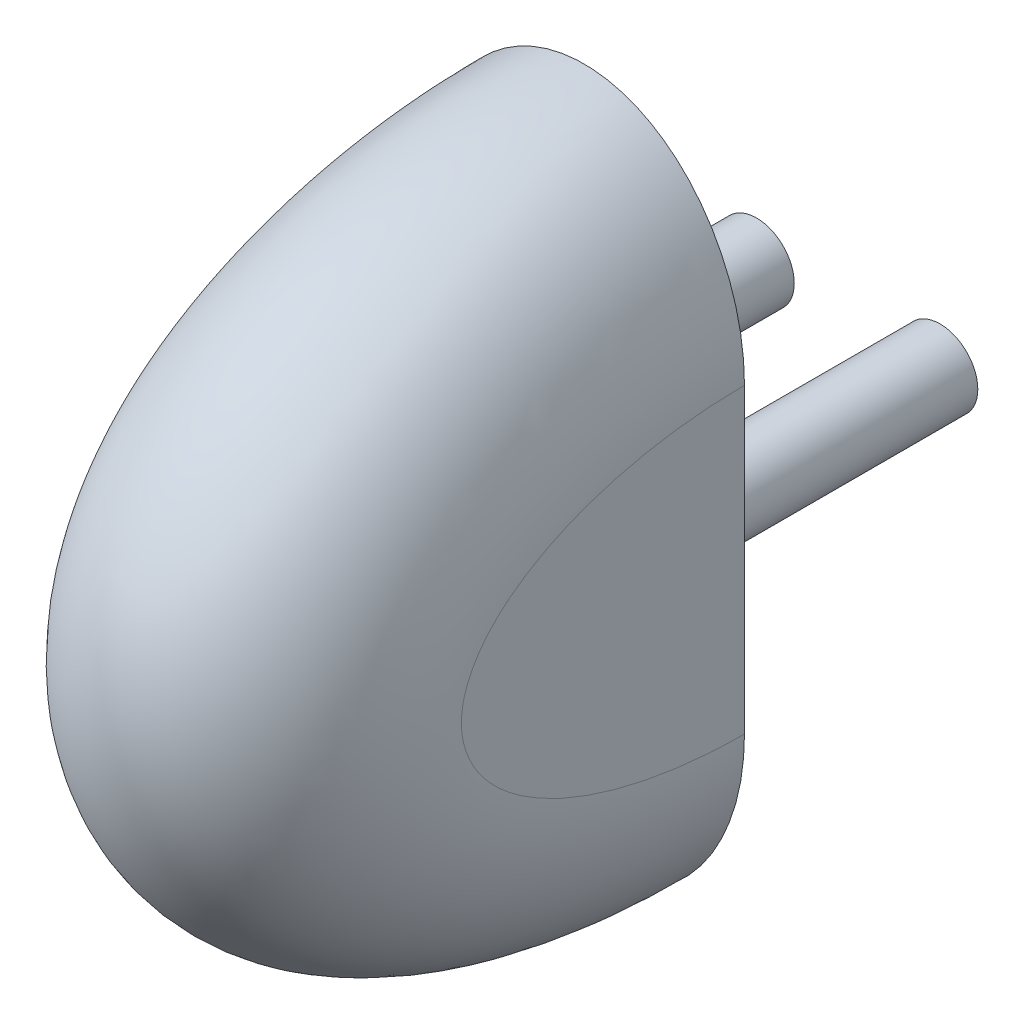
ISO-10303-21;
HEADER;
FILE_DESCRIPTION(('STEP AP214'),'2;1');
FILE_NAME('part.step','',(''),(''),'','','');
FILE_SCHEMA(('AUTOMOTIVE_DESIGN { 1 0 10303 214 1 1 1 1 }'));
ENDSEC;
DATA;
#1=APPLICATION_CONTEXT('core data for automotive mechanical design processes');
#2=APPLICATION_PROTOCOL_DEFINITION('international standard','automotive_design',2000,#1);
#3=PRODUCT_CONTEXT('',#1,'mechanical');
#4=PRODUCT('Part','Part','',(#3));
#5=PRODUCT_RELATED_PRODUCT_CATEGORY('part','',(#4));
#6=PRODUCT_DEFINITION_FORMATION('','',#4);
#7=PRODUCT_DEFINITION_CONTEXT('part definition',#1,'design');
#8=PRODUCT_DEFINITION('design','',#6,#7);
#9=PRODUCT_DEFINITION_SHAPE('','',#8);
#10=(LENGTH_UNIT() NAMED_UNIT(*) SI_UNIT(.MILLI.,.METRE.));
#11=(NAMED_UNIT(*) PLANE_ANGLE_UNIT() SI_UNIT($,.RADIAN.));
#12=(NAMED_UNIT(*) SI_UNIT($,.STERADIAN.) SOLID_ANGLE_UNIT());
#13=UNCERTAINTY_MEASURE_WITH_UNIT(LENGTH_MEASURE(1.E-05),#10,'distance_accuracy_value','');
#14=(GEOMETRIC_REPRESENTATION_CONTEXT(3) GLOBAL_UNCERTAINTY_ASSIGNED_CONTEXT((#13)) GLOBAL_UNIT_ASSIGNED_CONTEXT((#10,
#11,#12)) REPRESENTATION_CONTEXT('',''));
#15=CARTESIAN_POINT('',(0.,0.,0.));
#16=DIRECTION('',(0.,0.,1.));
#17=DIRECTION('',(1.,0.,0.));
#18=AXIS2_PLACEMENT_3D('',#15,#16,#17);
#19=CARTESIAN_POINT('',(0.,0.,0.));
#20=DIRECTION('',(0.,0.,1.));
#21=DIRECTION('',(1.,0.,0.));
#22=AXIS2_PLACEMENT_3D('',#19,#20,#21);
#23=PLANE('',#22);
#24=CARTESIAN_POINT('',(4.86306893,-8.,0.));
#25=DIRECTION('',(0.,0.,1.));
#26=DIRECTION('',(1.,0.,0.));
#27=AXIS2_PLACEMENT_3D('',#24,#25,#26);
#28=CIRCLE('',#27,2.);
#29=CARTESIAN_POINT('',(6.86306893,-8.,0.));
#30=VERTEX_POINT('',#29);
#31=EDGE_CURVE('E75',#30,#30,#28,.F.);
#32=ORIENTED_EDGE('',*,*,#31,.F.);
#33=EDGE_LOOP('',(#32));
#34=FACE_BOUND('',#33,.T.);
#35=CARTESIAN_POINT('',(0.,0.,0.));
#36=DIRECTION('',(0.,0.,1.));
#37=DIRECTION('',(0.,1.,0.));
#38=AXIS2_PLACEMENT_3D('',#35,#36,#37);
#39=ELLIPSE('',#38,10.5,8.5);
#40=CARTESIAN_POINT('',(8.5,0.,0.));
#41=VERTEX_POINT('',#40);
#42=CARTESIAN_POINT('',(-8.5,0.,0.));
#43=VERTEX_POINT('',#42);
#44=EDGE_CURVE('E104',#41,#43,#39,.T.);
#45=ORIENTED_EDGE('',*,*,#44,.F.);
#46=DIRECTION('',(0.,-1.,0.));
#47=VECTOR('',#46,1.);
#48=CARTESIAN_POINT('',(8.5,-16.,0.));
#49=LINE('',#48,#47);
#50=CARTESIAN_POINT('',(8.5,-16.,0.));
#51=VERTEX_POINT('',#50);
#52=EDGE_CURVE('E105',#41,#51,#49,.T.);
#53=ORIENTED_EDGE('',*,*,#52,.T.);
#54=CARTESIAN_POINT('',(0.,-16.,0.));
#55=DIRECTION('',(0.,0.,-1.));
#56=DIRECTION('',(0.,-1.,0.));
#57=AXIS2_PLACEMENT_3D('',#54,#55,#56);
#58=ELLIPSE('',#57,10.5,8.5);
#59=CARTESIAN_POINT('',(-8.5,-16.,0.));
#60=VERTEX_POINT('',#59);
#61=EDGE_CURVE('E99',#51,#60,#58,.T.);
#62=ORIENTED_EDGE('',*,*,#61,.T.);
#63=DIRECTION('',(0.,1.,0.));
#64=VECTOR('',#63,1.);
#65=CARTESIAN_POINT('',(-8.5,0.,0.));
#66=LINE('',#65,#64);
#67=EDGE_CURVE('E81',#60,#43,#66,.T.);
#68=ORIENTED_EDGE('',*,*,#67,.T.);
#69=EDGE_LOOP('',(#45,#53,#62,#68));
#70=FACE_BOUND('',#69,.T.);
#71=CARTESIAN_POINT('',(0.,0.,0.));
#72=DIRECTION('',(0.,0.,-1.));
#73=DIRECTION('',(0.,1.,0.));
#74=AXIS2_PLACEMENT_3D('',#71,#72,#73);
#75=ELLIPSE('',#74,6.07894736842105,4.92105263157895);
#76=CARTESIAN_POINT('',(0.,6.07894736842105,0.));
#77=VERTEX_POINT('',#76);
#78=EDGE_CURVE('E131',#77,#77,#75,.T.);
#79=ORIENTED_EDGE('',*,*,#78,.F.);
#80=EDGE_LOOP('',(#79));
#81=FACE_BOUND('',#80,.T.);
#82=CARTESIAN_POINT('',(0.,-16.,0.));
#83=DIRECTION('',(0.,0.,1.));
#84=DIRECTION('',(0.,-1.,0.));
#85=AXIS2_PLACEMENT_3D('',#82,#83,#84);
#86=ELLIPSE('',#85,6.07894736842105,4.92105263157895);
#87=CARTESIAN_POINT('',(0.,-22.078947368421,0.));
#88=VERTEX_POINT('',#87);
#89=EDGE_CURVE('E122',#88,#88,#86,.T.);
#90=ORIENTED_EDGE('',*,*,#89,.T.);
#91=EDGE_LOOP('',(#90));
#92=FACE_BOUND('',#91,.T.);
#93=CARTESIAN_POINT('',(-4.86306893,-8.,0.));
#94=DIRECTION('',(0.,0.,1.));
#95=DIRECTION('',(1.,0.,0.));
#96=AXIS2_PLACEMENT_3D('',#93,#94,#95);
#97=CIRCLE('',#96,2.);
#98=CARTESIAN_POINT('',(-2.86306893,-8.,0.));
#99=VERTEX_POINT('',#98);
#100=EDGE_CURVE('E12',#99,#99,#97,.F.);
#101=ORIENTED_EDGE('',*,*,#100,.F.);
#102=EDGE_LOOP('',(#101));
#103=FACE_BOUND('',#102,.T.);
#104=ADVANCED_FACE('F65',(#34,#70,#81,#92,#103),#23,.F.);
#105=CARTESIAN_POINT('',(8.5,0.,0.));
#106=CARTESIAN_POINT('',(8.5,0.,0.833333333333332));
#107=CARTESIAN_POINT('',(8.5,-0.0540444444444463,2.19266666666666));
#108=CARTESIAN_POINT('',(8.5,-0.240355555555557,3.688));
#109=CARTESIAN_POINT('',(8.5,-0.399644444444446,4.712));
#110=CARTESIAN_POINT('',(8.5,-0.692622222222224,6.29066666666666));
#111=CARTESIAN_POINT('',(8.5,-1.17333333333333,7.93333333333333));
#112=CARTESIAN_POINT('',(8.5,-1.92,9.79999999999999));
#113=CARTESIAN_POINT('',(8.5,-2.68401384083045,11.3640138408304));
#114=CARTESIAN_POINT('',(8.5,-3.68166089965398,12.681660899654));
#115=CARTESIAN_POINT('',(8.5,-4.5121107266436,13.5121107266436));
#116=CARTESIAN_POINT('',(8.5,-5.09284890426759,14.0095155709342));
#117=CARTESIAN_POINT('',(8.5,-6.02580738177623,14.5674740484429));
#118=CARTESIAN_POINT('',(8.5,-7.00115340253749,14.9178200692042));
#119=CARTESIAN_POINT('',(8.5,-7.66666666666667,15.));
#120=CARTESIAN_POINT('',(8.5,-8.33333333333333,15.));
#121=CARTESIAN_POINT('',(8.5,-8.99884659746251,14.9178200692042));
#122=CARTESIAN_POINT('',(8.5,-9.97419261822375,14.5674740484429));
#123=CARTESIAN_POINT('',(8.5,-10.9071510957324,14.0095155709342));
#124=CARTESIAN_POINT('',(8.5,-11.4878892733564,13.5121107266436));
#125=CARTESIAN_POINT('',(8.5,-12.318339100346,12.681660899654));
#126=CARTESIAN_POINT('',(8.5,-13.3159861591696,11.3640138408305));
#127=CARTESIAN_POINT('',(8.5,-14.08,9.8));
#128=CARTESIAN_POINT('',(8.5,-14.8266666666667,7.93333333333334));
#129=CARTESIAN_POINT('',(8.5,-15.3073777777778,6.29066666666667));
#130=CARTESIAN_POINT('',(8.5,-15.6003555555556,4.712));
#131=CARTESIAN_POINT('',(8.5,-15.7596444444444,3.688));
#132=CARTESIAN_POINT('',(8.5,-15.9459555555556,2.19266666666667));
#133=CARTESIAN_POINT('',(8.5,-16.,0.83333333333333));
#134=CARTESIAN_POINT('',(8.5,-16.,0.));
#135=CARTESIAN_POINT('',(8.5,21.,0.));
#136=CARTESIAN_POINT('',(8.5,20.9845247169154,1.48820448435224));
#137=CARTESIAN_POINT('',(8.5,20.9072673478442,3.82984454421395));
#138=CARTESIAN_POINT('',(8.5,20.5765434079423,6.49945358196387));
#139=CARTESIAN_POINT('',(8.5,20.2865075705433,8.35623279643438));
#140=CARTESIAN_POINT('',(8.5,19.7457017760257,11.258961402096));
#141=CARTESIAN_POINT('',(8.5,18.8281169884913,14.4830797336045));
#142=CARTESIAN_POINT('',(8.5,17.2004306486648,18.5362975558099));
#143=CARTESIAN_POINT('',(8.5,15.4425425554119,22.1940493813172));
#144=CARTESIAN_POINT('',(8.5,12.6133211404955,26.0987885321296));
#145=CARTESIAN_POINT('',(8.5,9.61426186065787,29.077410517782));
#146=CARTESIAN_POINT('',(8.5,7.32280781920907,31.0762144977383));
#147=CARTESIAN_POINT('',(8.50000000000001,3.143650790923,33.6013102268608));
#148=CARTESIAN_POINT('',(8.5,-1.94303160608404,35.4857329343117));
#149=CARTESIAN_POINT('',(8.5,-5.98062606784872,36.));
#150=CARTESIAN_POINT('',(8.5,-10.019373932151,36.));
#151=CARTESIAN_POINT('',(8.5,-14.0569683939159,35.4857329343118));
#152=CARTESIAN_POINT('',(8.5,-19.1436507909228,33.6013102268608));
#153=CARTESIAN_POINT('',(8.5,-23.322807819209,31.0762144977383));
#154=CARTESIAN_POINT('',(8.5,-25.6142618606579,29.077410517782));
#155=CARTESIAN_POINT('',(8.5,-28.6133211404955,26.0987885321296));
#156=CARTESIAN_POINT('',(8.5,-31.4425425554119,22.1940493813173));
#157=CARTESIAN_POINT('',(8.5,-33.2004306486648,18.5362975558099));
#158=CARTESIAN_POINT('',(8.5,-34.8281169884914,14.4830797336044));
#159=CARTESIAN_POINT('',(8.5,-35.7457017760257,11.258961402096));
#160=CARTESIAN_POINT('',(8.5,-36.2865075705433,8.35623279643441));
#161=CARTESIAN_POINT('',(8.5,-36.5765434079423,6.49945358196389));
#162=CARTESIAN_POINT('',(8.5,-36.9072673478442,3.82984454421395));
#163=CARTESIAN_POINT('',(8.5,-36.9845247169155,1.48820448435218));
#164=CARTESIAN_POINT('',(8.5,-37.,-1.17078120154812E-13));
#165=CARTESIAN_POINT('',(-8.5,21.,0.));
#166=CARTESIAN_POINT('',(-8.5,20.9845247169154,1.48820448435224));
#167=CARTESIAN_POINT('',(-8.5,20.9072673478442,3.82984454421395));
#168=CARTESIAN_POINT('',(-8.5,20.5765434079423,6.49945358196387));
#169=CARTESIAN_POINT('',(-8.5,20.2865075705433,8.35623279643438));
#170=CARTESIAN_POINT('',(-8.5,19.7457017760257,11.258961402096));
#171=CARTESIAN_POINT('',(-8.5,18.8281169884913,14.4830797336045));
#172=CARTESIAN_POINT('',(-8.5,17.2004306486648,18.5362975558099));
#173=CARTESIAN_POINT('',(-8.5,15.4425425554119,22.1940493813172));
#174=CARTESIAN_POINT('',(-8.5,12.6133211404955,26.0987885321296));
#175=CARTESIAN_POINT('',(-8.5,9.61426186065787,29.077410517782));
#176=CARTESIAN_POINT('',(-8.5,7.32280781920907,31.0762144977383));
#177=CARTESIAN_POINT('',(-8.5,3.143650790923,33.6013102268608));
#178=CARTESIAN_POINT('',(-8.49999999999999,-1.94303160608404,35.4857329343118));
#179=CARTESIAN_POINT('',(-8.5,-5.98062606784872,36.));
#180=CARTESIAN_POINT('',(-8.5,-10.019373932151,36.));
#181=CARTESIAN_POINT('',(-8.5,-14.0569683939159,35.4857329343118));
#182=CARTESIAN_POINT('',(-8.5,-19.1436507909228,33.6013102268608));
#183=CARTESIAN_POINT('',(-8.5,-23.322807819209,31.0762144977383));
#184=CARTESIAN_POINT('',(-8.5,-25.6142618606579,29.077410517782));
#185=CARTESIAN_POINT('',(-8.5,-28.6133211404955,26.0987885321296));
#186=CARTESIAN_POINT('',(-8.5,-31.4425425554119,22.1940493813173));
#187=CARTESIAN_POINT('',(-8.5,-33.2004306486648,18.5362975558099));
#188=CARTESIAN_POINT('',(-8.5,-34.8281169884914,14.4830797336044));
#189=CARTESIAN_POINT('',(-8.5,-35.7457017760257,11.258961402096));
#190=CARTESIAN_POINT('',(-8.5,-36.2865075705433,8.35623279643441));
#191=CARTESIAN_POINT('',(-8.5,-36.5765434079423,6.4994535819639));
#192=CARTESIAN_POINT('',(-8.5,-36.9072673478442,3.82984454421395));
#193=CARTESIAN_POINT('',(-8.5,-36.9845247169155,1.48820448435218));
#194=CARTESIAN_POINT('',(-8.5,-37.,-1.17078120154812E-13));
#195=CARTESIAN_POINT('',(-8.5,0.,0.));
#196=CARTESIAN_POINT('',(-8.5,0.,0.833333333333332));
#197=CARTESIAN_POINT('',(-8.5,-0.0540444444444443,2.19266666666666));
#198=CARTESIAN_POINT('',(-8.5,-0.240355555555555,3.688));
#199=CARTESIAN_POINT('',(-8.5,-0.399644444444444,4.712));
#200=CARTESIAN_POINT('',(-8.5,-0.692622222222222,6.29066666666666));
#201=CARTESIAN_POINT('',(-8.5,-1.17333333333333,7.93333333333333));
#202=CARTESIAN_POINT('',(-8.5,-1.92,9.79999999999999));
#203=CARTESIAN_POINT('',(-8.5,-2.68401384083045,11.3640138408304));
#204=CARTESIAN_POINT('',(-8.5,-3.68166089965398,12.681660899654));
#205=CARTESIAN_POINT('',(-8.5,-4.5121107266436,13.5121107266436));
#206=CARTESIAN_POINT('',(-8.5,-5.09284890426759,14.0095155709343));
#207=CARTESIAN_POINT('',(-8.5,-6.02580738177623,14.5674740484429));
#208=CARTESIAN_POINT('',(-8.5,-7.00115340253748,14.9178200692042));
#209=CARTESIAN_POINT('',(-8.5,-7.66666666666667,15.));
#210=CARTESIAN_POINT('',(-8.5,-8.33333333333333,15.));
#211=CARTESIAN_POINT('',(-8.5,-8.99884659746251,14.9178200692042));
#212=CARTESIAN_POINT('',(-8.5,-9.97419261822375,14.5674740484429));
#213=CARTESIAN_POINT('',(-8.5,-10.9071510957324,14.0095155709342));
#214=CARTESIAN_POINT('',(-8.5,-11.4878892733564,13.5121107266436));
#215=CARTESIAN_POINT('',(-8.5,-12.318339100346,12.681660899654));
#216=CARTESIAN_POINT('',(-8.5,-13.3159861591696,11.3640138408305));
#217=CARTESIAN_POINT('',(-8.5,-14.08,9.8));
#218=CARTESIAN_POINT('',(-8.5,-14.8266666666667,7.93333333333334));
#219=CARTESIAN_POINT('',(-8.5,-15.3073777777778,6.29066666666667));
#220=CARTESIAN_POINT('',(-8.5,-15.6003555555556,4.712));
#221=CARTESIAN_POINT('',(-8.5,-15.7596444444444,3.688));
#222=CARTESIAN_POINT('',(-8.5,-15.9459555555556,2.19266666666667));
#223=CARTESIAN_POINT('',(-8.5,-16.,0.83333333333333));
#224=CARTESIAN_POINT('',(-8.5,-16.,0.));
#225=(BOUNDED_SURFACE() B_SPLINE_SURFACE(3,3,((#105,#106,#107,#108,#109,#110,#111,#112,#113,
#114,#115,#116,#117,#118,#119,#120,#121,#122,#123,#124,#125,#126,#127,#128,#129,#130,#131,#132,
#133,#134),(#135,#136,#137,#138,#139,#140,#141,#142,#143,#144,#145,#146,#147,#148,#149,#150,
#151,#152,#153,#154,#155,#156,#157,#158,#159,#160,#161,#162,#163,#164),(#165,#166,#167,#168,
#169,#170,#171,#172,#173,#174,#175,#176,#177,#178,#179,#180,#181,#182,#183,#184,#185,#186,#187,
#188,#189,#190,#191,#192,#193,#194),(#195,#196,#197,#198,#199,#200,#201,#202,#203,#204,#205,
#206,#207,#208,#209,#210,#211,#212,#213,#214,#215,#216,#217,#218,#219,#220,#221,#222,#223,
#224)),.UNSPECIFIED.,.F.,.F.,.F.) B_SPLINE_SURFACE_WITH_KNOTS((4,4),(4,1,2,1,2,1,2,1,1,1,2,1,1,
1,2,1,2,1,2,1,4),(0.,0.552631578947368),(0.,0.0833333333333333,0.125,0.166666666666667,0.25,
0.3125,0.375,0.40625,0.4375,0.46875,0.5,0.53125,0.5625,0.59375,0.625,0.6875,0.75,
0.833333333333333,0.875,0.916666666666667,1.),
.UNSPECIFIED.) GEOMETRIC_REPRESENTATION_ITEM() RATIONAL_B_SPLINE_SURFACE(((1.,1.,1.,1.,1.,1.,1.,
1.,1.,1.,1.,1.,1.,1.,1.,1.,1.,1.,1.,1.,1.,1.,1.,1.,1.,1.,1.,1.,1.,1.),(0.333333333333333,
0.333333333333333,0.333333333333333,0.333333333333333,0.333333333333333,0.333333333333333,
0.333333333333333,0.333333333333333,0.333333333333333,0.333333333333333,0.333333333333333,
0.333333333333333,0.333333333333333,0.333333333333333,0.333333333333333,0.333333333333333,
0.333333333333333,0.333333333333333,0.333333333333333,0.333333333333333,0.333333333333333,
0.333333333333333,0.333333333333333,0.333333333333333,0.333333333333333,0.333333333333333,
0.333333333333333,0.333333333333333,0.333333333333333,0.333333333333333),(0.333333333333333,
0.333333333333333,0.333333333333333,0.333333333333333,0.333333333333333,0.333333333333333,
0.333333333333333,0.333333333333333,0.333333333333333,0.333333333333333,0.333333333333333,
0.333333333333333,0.333333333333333,0.333333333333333,0.333333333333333,0.333333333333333,
0.333333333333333,0.333333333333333,0.333333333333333,0.333333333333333,0.333333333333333,
0.333333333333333,0.333333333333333,0.333333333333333,0.333333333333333,0.333333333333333,
0.333333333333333,0.333333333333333,0.333333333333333,0.333333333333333),(1.,1.,1.,1.,1.,1.,1.,
1.,1.,1.,1.,1.,1.,1.,1.,1.,1.,1.,1.,1.,1.,1.,1.,1.,1.,1.,1.,1.,1.,1.))) REPRESENTATION_ITEM('') SURFACE());
#226=CARTESIAN_POINT('',(-8.5,0.,0.));
#227=CARTESIAN_POINT('',(-8.5,0.,0.833333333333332));
#228=CARTESIAN_POINT('',(-8.5,-0.0540444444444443,2.19266666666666));
#229=CARTESIAN_POINT('',(-8.5,-0.240355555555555,3.688));
#230=CARTESIAN_POINT('',(-8.5,-0.399644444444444,4.712));
#231=CARTESIAN_POINT('',(-8.5,-0.692622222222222,6.29066666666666));
#232=CARTESIAN_POINT('',(-8.5,-1.17333333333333,7.93333333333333));
#233=CARTESIAN_POINT('',(-8.5,-1.92,9.79999999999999));
#234=CARTESIAN_POINT('',(-8.5,-2.68401384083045,11.3640138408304));
#235=CARTESIAN_POINT('',(-8.5,-3.68166089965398,12.681660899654));
#236=CARTESIAN_POINT('',(-8.5,-4.5121107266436,13.5121107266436));
#237=CARTESIAN_POINT('',(-8.5,-5.09284890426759,14.0095155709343));
#238=CARTESIAN_POINT('',(-8.5,-6.02580738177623,14.5674740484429));
#239=CARTESIAN_POINT('',(-8.5,-7.00115340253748,14.9178200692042));
#240=CARTESIAN_POINT('',(-8.5,-7.66666666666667,15.));
#241=CARTESIAN_POINT('',(-8.5,-8.33333333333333,15.));
#242=CARTESIAN_POINT('',(-8.5,-8.99884659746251,14.9178200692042));
#243=CARTESIAN_POINT('',(-8.5,-9.97419261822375,14.5674740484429));
#244=CARTESIAN_POINT('',(-8.5,-10.9071510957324,14.0095155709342));
#245=CARTESIAN_POINT('',(-8.5,-11.4878892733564,13.5121107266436));
#246=CARTESIAN_POINT('',(-8.5,-12.318339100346,12.681660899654));
#247=CARTESIAN_POINT('',(-8.5,-13.3159861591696,11.3640138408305));
#248=CARTESIAN_POINT('',(-8.5,-14.08,9.8));
#249=CARTESIAN_POINT('',(-8.5,-14.8266666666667,7.93333333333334));
#250=CARTESIAN_POINT('',(-8.5,-15.3073777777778,6.29066666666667));
#251=CARTESIAN_POINT('',(-8.5,-15.6003555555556,4.712));
#252=CARTESIAN_POINT('',(-8.5,-15.7596444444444,3.688));
#253=CARTESIAN_POINT('',(-8.5,-15.9459555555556,2.19266666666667));
#254=CARTESIAN_POINT('',(-8.5,-16.,0.83333333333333));
#255=CARTESIAN_POINT('',(-8.5,-16.,0.));
#256=B_SPLINE_CURVE_WITH_KNOTS('',3,(#226,#227,#228,#229,#230,#231,#232,#233,#234,#235,#236,
#237,#238,#239,#240,#241,#242,#243,#244,#245,#246,#247,#248,#249,#250,#251,#252,#253,#254,#255),
.UNSPECIFIED.,.F.,.F.,(4,1,2,1,2,1,2,1,1,1,2,1,1,1,2,1,2,1,2,1,4),(0.,0.0833333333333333,0.125,
0.166666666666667,0.25,0.3125,0.375,0.40625,0.4375,0.46875,0.5,0.53125,0.5625,0.59375,0.625,
0.6875,0.75,0.833333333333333,0.875,0.916666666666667,1.),.UNSPECIFIED.);
#257=EDGE_CURVE('E93',#43,#60,#256,.T.);
#258=CARTESIAN_POINT('',(8.5,0.,0.));
#259=CARTESIAN_POINT('',(8.5,0.,0.833333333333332));
#260=CARTESIAN_POINT('',(8.5,-0.0540444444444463,2.19266666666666));
#261=CARTESIAN_POINT('',(8.5,-0.240355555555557,3.688));
#262=CARTESIAN_POINT('',(8.5,-0.399644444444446,4.712));
#263=CARTESIAN_POINT('',(8.5,-0.692622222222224,6.29066666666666));
#264=CARTESIAN_POINT('',(8.5,-1.17333333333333,7.93333333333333));
#265=CARTESIAN_POINT('',(8.5,-1.92,9.79999999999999));
#266=CARTESIAN_POINT('',(8.5,-2.68401384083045,11.3640138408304));
#267=CARTESIAN_POINT('',(8.5,-3.68166089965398,12.681660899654));
#268=CARTESIAN_POINT('',(8.5,-4.5121107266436,13.5121107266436));
#269=CARTESIAN_POINT('',(8.5,-5.09284890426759,14.0095155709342));
#270=CARTESIAN_POINT('',(8.5,-6.02580738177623,14.5674740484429));
#271=CARTESIAN_POINT('',(8.5,-7.00115340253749,14.9178200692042));
#272=CARTESIAN_POINT('',(8.5,-7.66666666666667,15.));
#273=CARTESIAN_POINT('',(8.5,-8.33333333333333,15.));
#274=CARTESIAN_POINT('',(8.5,-8.99884659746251,14.9178200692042));
#275=CARTESIAN_POINT('',(8.5,-9.97419261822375,14.5674740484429));
#276=CARTESIAN_POINT('',(8.5,-10.9071510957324,14.0095155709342));
#277=CARTESIAN_POINT('',(8.5,-11.4878892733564,13.5121107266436));
#278=CARTESIAN_POINT('',(8.5,-12.318339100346,12.681660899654));
#279=CARTESIAN_POINT('',(8.5,-13.3159861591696,11.3640138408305));
#280=CARTESIAN_POINT('',(8.5,-14.08,9.8));
#281=CARTESIAN_POINT('',(8.5,-14.8266666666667,7.93333333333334));
#282=CARTESIAN_POINT('',(8.5,-15.3073777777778,6.29066666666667));
#283=CARTESIAN_POINT('',(8.5,-15.6003555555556,4.712));
#284=CARTESIAN_POINT('',(8.5,-15.7596444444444,3.688));
#285=CARTESIAN_POINT('',(8.5,-15.9459555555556,2.19266666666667));
#286=CARTESIAN_POINT('',(8.5,-16.,0.83333333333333));
#287=CARTESIAN_POINT('',(8.5,-16.,0.));
#288=B_SPLINE_CURVE_WITH_KNOTS('',3,(#258,#259,#260,#261,#262,#263,#264,#265,#266,#267,#268,
#269,#270,#271,#272,#273,#274,#275,#276,#277,#278,#279,#280,#281,#282,#283,#284,#285,#286,#287),
.UNSPECIFIED.,.F.,.F.,(4,1,2,1,2,1,2,1,1,1,2,1,1,1,2,1,2,1,2,1,4),(0.,0.0833333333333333,0.125,
0.166666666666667,0.25,0.3125,0.375,0.40625,0.4375,0.46875,0.5,0.53125,0.5625,0.59375,0.625,
0.6875,0.75,0.833333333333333,0.875,0.916666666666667,1.),.UNSPECIFIED.);
#289=EDGE_CURVE('E88',#41,#51,#288,.T.);
#290=ORIENTED_EDGE('',*,*,#44,.T.);
#291=ORIENTED_EDGE('',*,*,#257,.T.);
#292=ORIENTED_EDGE('',*,*,#61,.F.);
#293=ORIENTED_EDGE('',*,*,#289,.F.);
#294=EDGE_LOOP('',(#290,#291,#292,#293));
#295=FACE_BOUND('',#294,.T.);
#296=ADVANCED_FACE('F67',(#295),#225,.T.);
#297=CARTESIAN_POINT('',(8.5,-16.,500000.));
#298=DIRECTION('',(1.,0.,0.));
#299=DIRECTION('',(0.,0.,-1.));
#300=AXIS2_PLACEMENT_3D('',#297,#298,#299);
#301=PLANE('',#300);
#302=ORIENTED_EDGE('',*,*,#289,.T.);
#303=ORIENTED_EDGE('',*,*,#52,.F.);
#304=EDGE_LOOP('',(#302,#303));
#305=FACE_BOUND('',#304,.T.);
#306=ADVANCED_FACE('F140',(#305),#301,.T.);
#307=CARTESIAN_POINT('',(-8.5,0.,500000.));
#308=DIRECTION('',(-1.,0.,0.));
#309=DIRECTION('',(0.,0.,1.));
#310=AXIS2_PLACEMENT_3D('',#307,#308,#309);
#311=PLANE('',#310);
#312=ORIENTED_EDGE('',*,*,#257,.F.);
#313=ORIENTED_EDGE('',*,*,#67,.F.);
#314=EDGE_LOOP('',(#312,#313));
#315=FACE_BOUND('',#314,.T.);
#316=ADVANCED_FACE('F94',(#315),#311,.T.);
#317=CARTESIAN_POINT('',(0.,-16.0000000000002,6.99999999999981));
#318=DIRECTION('',(0.,0.,1.));
#319=DIRECTION('',(0.,-1.,0.));
#320=AXIS2_PLACEMENT_3D('',#317,#318,#319);
#321=ELLIPSE('',#320,6.07894736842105,4.92105263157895);
#322=DIRECTION('',(0.,0.,-1.));
#323=VECTOR('',#322,1.);
#324=SURFACE_OF_LINEAR_EXTRUSION('',#321,#323);
#325=CARTESIAN_POINT('',(0.,-22.0789473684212,6.99999999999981));
#326=VERTEX_POINT('',#325);
#327=EDGE_CURVE('E126',#326,#326,#321,.T.);
#328=ORIENTED_EDGE('',*,*,#327,.T.);
#329=EDGE_LOOP('',(#328));
#330=FACE_BOUND('',#329,.T.);
#331=ORIENTED_EDGE('',*,*,#89,.F.);
#332=EDGE_LOOP('',(#331));
#333=FACE_BOUND('',#332,.T.);
#334=ADVANCED_FACE('F134',(#330,#333),#324,.T.);
#335=CARTESIAN_POINT('',(0.,1.96023752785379E-13,6.99999999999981));
#336=DIRECTION('',(0.,0.,-1.));
#337=DIRECTION('',(0.,1.,0.));
#338=AXIS2_PLACEMENT_3D('',#335,#336,#337);
#339=ELLIPSE('',#338,6.07894736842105,4.92105263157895);
#340=CARTESIAN_POINT('',(0.,-8.,6.99999999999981));
#341=DIRECTION('',(1.,0.,0.));
#342=AXIS1_PLACEMENT('',#340,#341);
#343=SURFACE_OF_REVOLUTION('',#339,#342);
#344=CARTESIAN_POINT('',(0.,6.07894736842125,6.99999999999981));
#345=VERTEX_POINT('',#344);
#346=EDGE_CURVE('E130',#345,#345,#339,.T.);
#347=ORIENTED_EDGE('',*,*,#346,.T.);
#348=EDGE_LOOP('',(#347));
#349=FACE_BOUND('',#348,.T.);
#350=ORIENTED_EDGE('',*,*,#327,.F.);
#351=EDGE_LOOP('',(#350));
#352=FACE_BOUND('',#351,.T.);
#353=ADVANCED_FACE('F138',(#349,#352),#343,.F.);
#354=DIRECTION('',(0.,0.,-1.));
#355=VECTOR('',#354,1.);
#356=SURFACE_OF_LINEAR_EXTRUSION('',#339,#355);
#357=ORIENTED_EDGE('',*,*,#346,.F.);
#358=EDGE_LOOP('',(#357));
#359=FACE_BOUND('',#358,.T.);
#360=ORIENTED_EDGE('',*,*,#78,.T.);
#361=EDGE_LOOP('',(#360));
#362=FACE_BOUND('',#361,.T.);
#363=ADVANCED_FACE('F155',(#359,#362),#356,.F.);
#364=CARTESIAN_POINT('',(4.86306893,-8.,-14.));
#365=DIRECTION('',(0.,0.,1.));
#366=DIRECTION('',(1.,0.,0.));
#367=AXIS2_PLACEMENT_3D('',#364,#365,#366);
#368=CYLINDRICAL_SURFACE('',#367,2.);
#369=CARTESIAN_POINT('',(4.86306893,-8.,-14.));
#370=DIRECTION('',(0.,0.,-1.));
#371=DIRECTION('',(-1.,0.,0.));
#372=AXIS2_PLACEMENT_3D('',#369,#370,#371);
#373=CIRCLE('',#372,2.);
#374=CARTESIAN_POINT('',(2.86306893,-8.,-14.));
#375=VERTEX_POINT('',#374);
#376=EDGE_CURVE('E171',#375,#375,#373,.T.);
#377=ORIENTED_EDGE('',*,*,#376,.F.);
#378=EDGE_LOOP('',(#377));
#379=FACE_BOUND('',#378,.T.);
#380=ORIENTED_EDGE('',*,*,#31,.T.);
#381=EDGE_LOOP('',(#380));
#382=FACE_BOUND('',#381,.T.);
#383=ADVANCED_FACE('F152',(#379,#382),#368,.T.);
#384=CARTESIAN_POINT('',(4.86306893,-8.,-14.));
#385=DIRECTION('',(0.,0.,-1.));
#386=DIRECTION('',(-1.,0.,0.));
#387=AXIS2_PLACEMENT_3D('',#384,#385,#386);
#388=PLANE('',#387);
#389=ORIENTED_EDGE('',*,*,#376,.T.);
#390=EDGE_LOOP('',(#389));
#391=FACE_BOUND('',#390,.T.);
#392=ADVANCED_FACE('F154',(#391),#388,.T.);
#393=CARTESIAN_POINT('',(-4.86306893,-8.,-14.));
#394=DIRECTION('',(0.,0.,1.));
#395=DIRECTION('',(1.,0.,0.));
#396=AXIS2_PLACEMENT_3D('',#393,#394,#395);
#397=CYLINDRICAL_SURFACE('',#396,2.);
#398=CARTESIAN_POINT('',(-4.86306893,-8.,-14.));
#399=DIRECTION('',(0.,0.,-1.));
#400=DIRECTION('',(1.,0.,0.));
#401=AXIS2_PLACEMENT_3D('',#398,#399,#400);
#402=CIRCLE('',#401,2.);
#403=CARTESIAN_POINT('',(-2.86306893,-8.,-14.));
#404=VERTEX_POINT('',#403);
#405=EDGE_CURVE('E175',#404,#404,#402,.T.);
#406=ORIENTED_EDGE('',*,*,#405,.F.);
#407=EDGE_LOOP('',(#406));
#408=FACE_BOUND('',#407,.T.);
#409=ORIENTED_EDGE('',*,*,#100,.T.);
#410=EDGE_LOOP('',(#409));
#411=FACE_BOUND('',#410,.T.);
#412=ADVANCED_FACE('F162',(#408,#411),#397,.T.);
#413=CARTESIAN_POINT('',(-4.86306893,-8.,-14.));
#414=DIRECTION('',(0.,0.,1.));
#415=DIRECTION('',(1.,0.,0.));
#416=AXIS2_PLACEMENT_3D('',#413,#414,#415);
#417=PLANE('',#416);
#418=ORIENTED_EDGE('',*,*,#405,.T.);
#419=EDGE_LOOP('',(#418));
#420=FACE_BOUND('',#419,.T.);
#421=ADVANCED_FACE('F179',(#420),#417,.F.);
#422=CLOSED_SHELL('',(#104,#296,#306,#316,#334,#353,#363,#383,#392,#412,#421));
#423=MANIFOLD_SOLID_BREP('B2',#422);
#424=ADVANCED_BREP_SHAPE_REPRESENTATION('',(#18,#423),#14);
#425=SHAPE_DEFINITION_REPRESENTATION(#9,#424);
ENDSEC;
END-ISO-10303-21;
